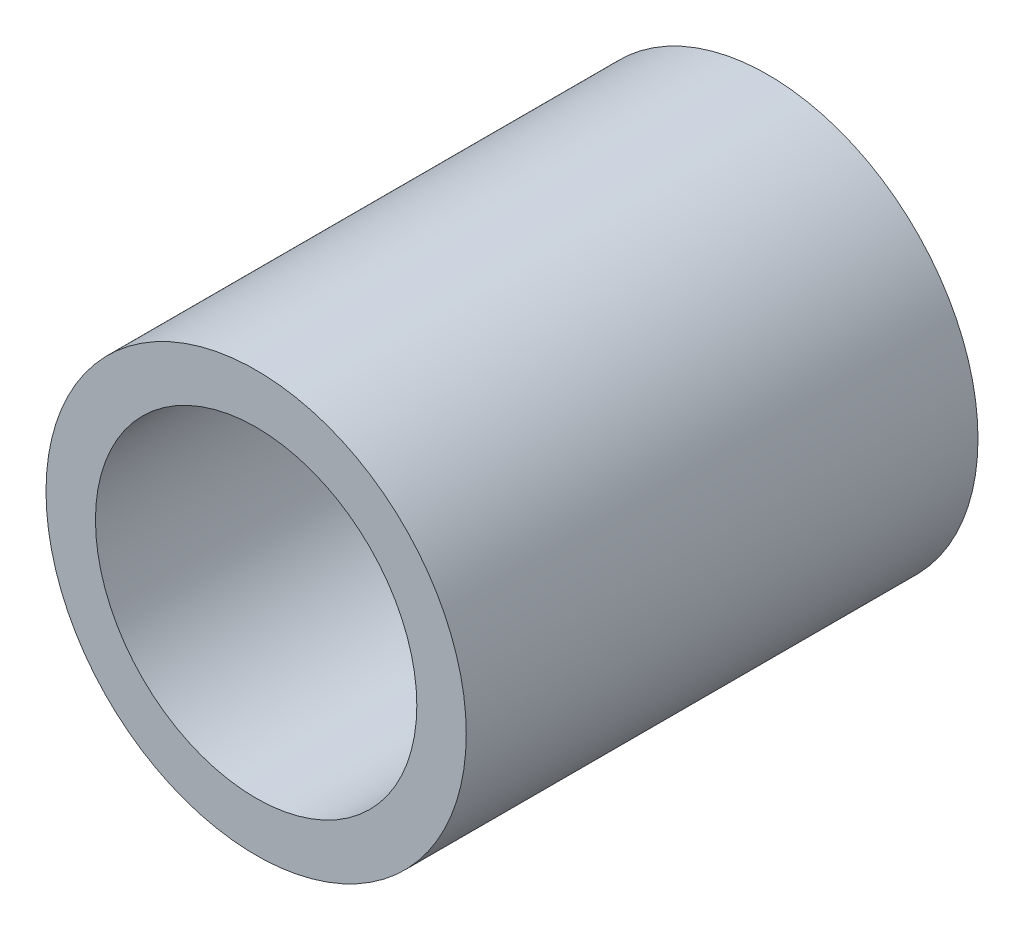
from build123d import *

# Parameters (mm, degrees)
ESQUISSE1_R            = 8.5
ESQUISSE1_R_2          = 6.5
BASE_EXTRU_MINCE_DEPTH = 20.7


with BuildPart() as part:
    # Esquisse1 → Base-Extru.-Mince (new body)
    with BuildSketch(Plane.XY):
        Circle(ESQUISSE1_R)
        Circle(ESQUISSE1_R_2, mode=Mode.SUBTRACT)
    extrude(amount=BASE_EXTRU_MINCE_DEPTH)


solid = part.part
